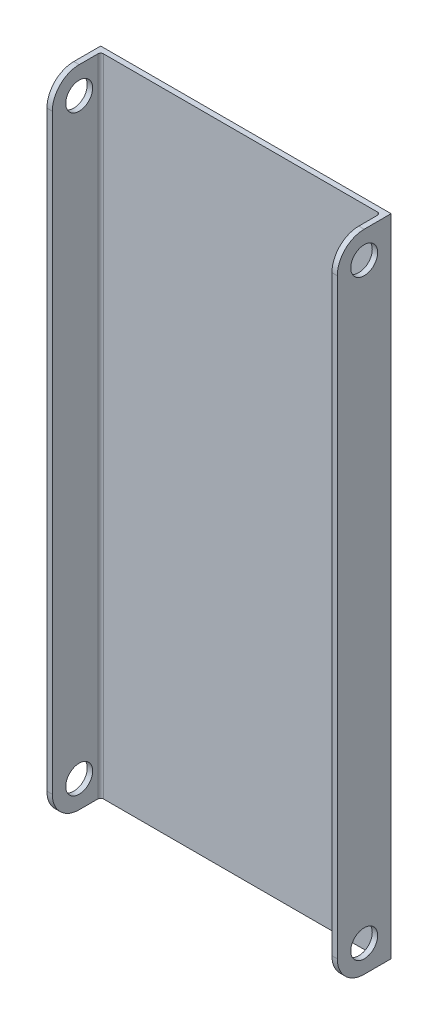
from build123d import *

# Parameters (mm, degrees)
SKETCH3_W           = 68.58
SKETCH3_H           = 152.4
BOSS_EXTRUDE1_DEPTH = 1.27
SKETCH4_W           = 12.7
SKETCH4_H           = 152.4
SKETCH4_R           = 3.175
BOSS_EXTRUDE2_DEPTH = 1.27
FILLET1_R           = 6.35
FILLET3_R           = 0.635


with BuildPart() as part:
    # Sketch3 → Boss-Extrude1 (new body)
    with BuildSketch(Plane.XY):
        with Locations((-34.29, 76.2)):
            Rectangle(SKETCH3_W, SKETCH3_H)
    extrude(amount=BOSS_EXTRUDE1_DEPTH)

    # Sketch4 → Boss-Extrude2 (add)
    with BuildSketch(Plane(origin=(0, 0, 0), x_dir=(0, 0, -1), z_dir=(1, 0, 0))):
        with Locations((-6.35, 76.2)):
            Rectangle(SKETCH4_W, SKETCH4_H)
        with Locations((-6.35, 6.35)):
            Circle(SKETCH4_R, mode=Mode.SUBTRACT)
        with Locations((-6.35, 146.05)):
            Circle(SKETCH4_R, mode=Mode.SUBTRACT)
    boss_extrude2 = extrude(amount=-BOSS_EXTRUDE2_DEPTH)

    # Mirror3: Boss-Extrude2 across plane
    add(boss_extrude2.mirror(Plane(origin=(-34.29, 0, 0), x_dir=(0, 0, 1), z_dir=(1, 0, 0))))

    # Fillet1
    fillet1_edges = [part.edges().sort_by_distance(p)[0] for p in [
        (-0.635, 0, 12.7),
        (-0.635, 152.4, 12.7),
        (-67.945, 152.4, 12.7),
        (-67.945, 0, 12.7),
    ]]
    fillet(fillet1_edges, radius=FILLET1_R)

    # Fillet3
    fillet3_edges = [part.edges().sort_by_distance(p)[0] for p in [
        (-1.27, 76.2, 1.27),
        (-67.31, 76.2, 1.27),
    ]]
    fillet(fillet3_edges, radius=FILLET3_R)


solid = part.part
